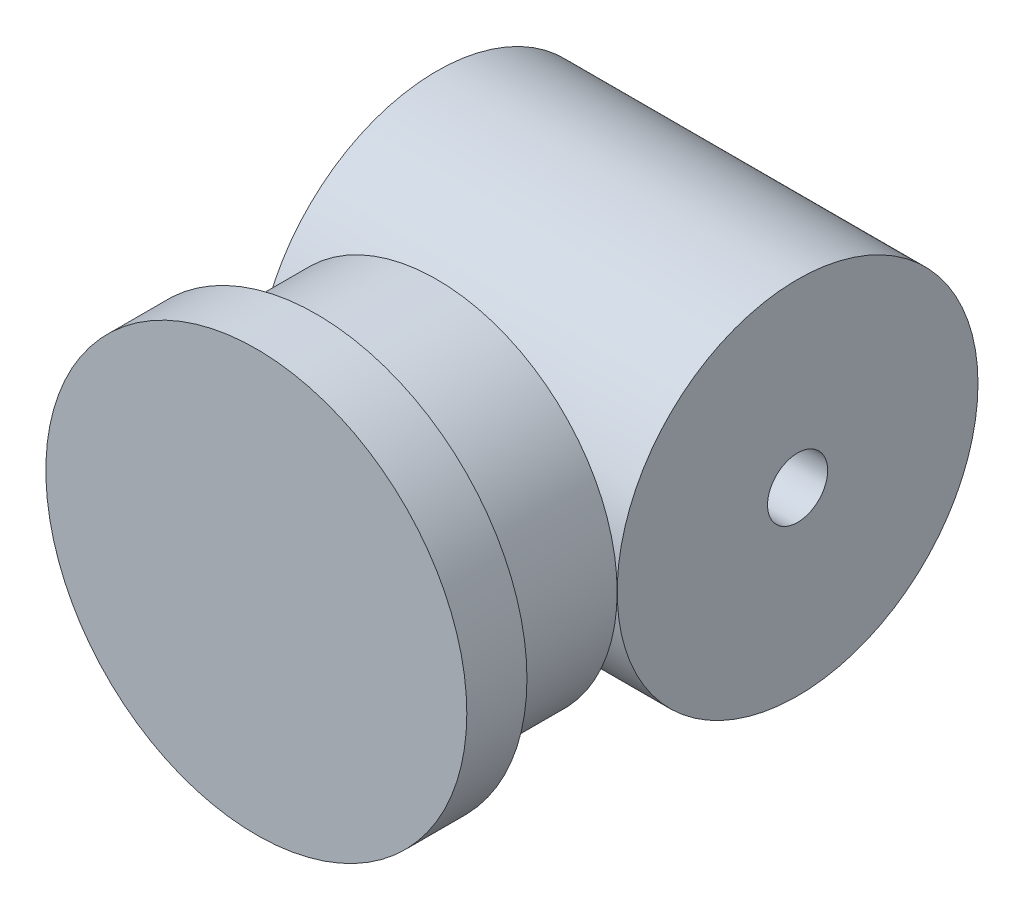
ISO-10303-21;
HEADER;
FILE_DESCRIPTION(('STEP AP214'),'2;1');
FILE_NAME('part.step','',(''),(''),'','','');
FILE_SCHEMA(('AUTOMOTIVE_DESIGN { 1 0 10303 214 1 1 1 1 }'));
ENDSEC;
DATA;
#1=APPLICATION_CONTEXT('core data for automotive mechanical design processes');
#2=APPLICATION_PROTOCOL_DEFINITION('international standard','automotive_design',2000,#1);
#3=PRODUCT_CONTEXT('',#1,'mechanical');
#4=PRODUCT('Part','Part','',(#3));
#5=PRODUCT_RELATED_PRODUCT_CATEGORY('part','',(#4));
#6=PRODUCT_DEFINITION_FORMATION('','',#4);
#7=PRODUCT_DEFINITION_CONTEXT('part definition',#1,'design');
#8=PRODUCT_DEFINITION('design','',#6,#7);
#9=PRODUCT_DEFINITION_SHAPE('','',#8);
#10=(LENGTH_UNIT() NAMED_UNIT(*) SI_UNIT(.MILLI.,.METRE.));
#11=(NAMED_UNIT(*) PLANE_ANGLE_UNIT() SI_UNIT($,.RADIAN.));
#12=(NAMED_UNIT(*) SI_UNIT($,.STERADIAN.) SOLID_ANGLE_UNIT());
#13=UNCERTAINTY_MEASURE_WITH_UNIT(LENGTH_MEASURE(1.E-05),#10,'distance_accuracy_value','');
#14=(GEOMETRIC_REPRESENTATION_CONTEXT(3) GLOBAL_UNCERTAINTY_ASSIGNED_CONTEXT((#13)) GLOBAL_UNIT_ASSIGNED_CONTEXT((#10,
#11,#12)) REPRESENTATION_CONTEXT('',''));
#15=CARTESIAN_POINT('',(0.,0.,0.));
#16=DIRECTION('',(0.,0.,1.));
#17=DIRECTION('',(1.,0.,0.));
#18=AXIS2_PLACEMENT_3D('',#15,#16,#17);
#19=CARTESIAN_POINT('',(30.,0.,-30.));
#20=DIRECTION('',(-1.,0.,0.));
#21=DIRECTION('',(0.,0.,1.));
#22=AXIS2_PLACEMENT_3D('',#19,#20,#21);
#23=CYLINDRICAL_SURFACE('',#22,30.);
#24=CARTESIAN_POINT('',(30.,0.,-30.));
#25=DIRECTION('',(1.,0.,0.));
#26=DIRECTION('',(0.,0.,-1.));
#27=AXIS2_PLACEMENT_3D('',#24,#25,#26);
#28=CIRCLE('',#27,30.);
#29=CARTESIAN_POINT('',(30.,0.,-60.));
#30=VERTEX_POINT('',#29);
#31=EDGE_CURVE('E11',#30,#30,#28,.T.);
#32=ORIENTED_EDGE('',*,*,#31,.F.);
#33=EDGE_LOOP('',(#32));
#34=FACE_BOUND('',#33,.T.);
#35=CARTESIAN_POINT('',(-30.,0.,-30.));
#36=DIRECTION('',(1.,0.,0.));
#37=DIRECTION('',(0.,0.,-1.));
#38=AXIS2_PLACEMENT_3D('',#35,#36,#37);
#39=CIRCLE('',#38,30.);
#40=CARTESIAN_POINT('',(-30.,0.,-60.));
#41=VERTEX_POINT('',#40);
#42=EDGE_CURVE('E46',#41,#41,#39,.T.);
#43=ORIENTED_EDGE('',*,*,#42,.T.);
#44=EDGE_LOOP('',(#43));
#45=FACE_BOUND('',#44,.T.);
#46=ADVANCED_FACE('F39',(#34,#45),#23,.T.);
#47=CARTESIAN_POINT('',(30.,0.,-30.));
#48=DIRECTION('',(1.,0.,0.));
#49=DIRECTION('',(0.,0.,-1.));
#50=AXIS2_PLACEMENT_3D('',#47,#48,#49);
#51=PLANE('',#50);
#52=CARTESIAN_POINT('',(30.,0.,-30.));
#53=DIRECTION('',(1.,0.,0.));
#54=DIRECTION('',(0.,0.,-1.));
#55=AXIS2_PLACEMENT_3D('',#52,#53,#54);
#56=CIRCLE('',#55,5.);
#57=CARTESIAN_POINT('',(30.,0.,-35.));
#58=VERTEX_POINT('',#57);
#59=EDGE_CURVE('E52',#58,#58,#56,.T.);
#60=ORIENTED_EDGE('',*,*,#59,.F.);
#61=EDGE_LOOP('',(#60));
#62=FACE_BOUND('',#61,.T.);
#63=ORIENTED_EDGE('',*,*,#31,.T.);
#64=EDGE_LOOP('',(#63));
#65=FACE_BOUND('',#64,.T.);
#66=ADVANCED_FACE('F68',(#62,#65),#51,.T.);
#67=CARTESIAN_POINT('',(-30.,0.,-30.));
#68=DIRECTION('',(1.,0.,0.));
#69=DIRECTION('',(0.,0.,-1.));
#70=AXIS2_PLACEMENT_3D('',#67,#68,#69);
#71=PLANE('',#70);
#72=CARTESIAN_POINT('',(-30.,0.,-30.));
#73=DIRECTION('',(1.,0.,0.));
#74=DIRECTION('',(0.,0.,-1.));
#75=AXIS2_PLACEMENT_3D('',#72,#73,#74);
#76=CIRCLE('',#75,5.);
#77=CARTESIAN_POINT('',(-30.,0.,-35.));
#78=VERTEX_POINT('',#77);
#79=EDGE_CURVE('E42',#78,#78,#76,.T.);
#80=ORIENTED_EDGE('',*,*,#79,.T.);
#81=EDGE_LOOP('',(#80));
#82=FACE_BOUND('',#81,.T.);
#83=ORIENTED_EDGE('',*,*,#42,.F.);
#84=EDGE_LOOP('',(#83));
#85=FACE_BOUND('',#84,.T.);
#86=ADVANCED_FACE('F59',(#82,#85),#71,.F.);
#87=CARTESIAN_POINT('',(-35.,0.,-30.));
#88=DIRECTION('',(1.,0.,0.));
#89=DIRECTION('',(0.,0.,-1.));
#90=AXIS2_PLACEMENT_3D('',#87,#88,#89);
#91=CYLINDRICAL_SURFACE('',#90,5.);
#92=ORIENTED_EDGE('',*,*,#59,.T.);
#93=EDGE_LOOP('',(#92));
#94=FACE_BOUND('',#93,.T.);
#95=ORIENTED_EDGE('',*,*,#79,.F.);
#96=EDGE_LOOP('',(#95));
#97=FACE_BOUND('',#96,.T.);
#98=ADVANCED_FACE('F62',(#94,#97),#91,.F.);
#99=CLOSED_SHELL('',(#46,#66,#86,#98));
#100=MANIFOLD_SOLID_BREP('B2',#99);
#101=CARTESIAN_POINT('',(0.,0.,20.));
#102=DIRECTION('',(0.,0.,-1.));
#103=DIRECTION('',(-1.,0.,0.));
#104=AXIS2_PLACEMENT_3D('',#101,#102,#103);
#105=CYLINDRICAL_SURFACE('',#104,30.);
#106=CARTESIAN_POINT('',(0.,0.,20.));
#107=DIRECTION('',(0.,0.,1.));
#108=DIRECTION('',(1.,0.,0.));
#109=AXIS2_PLACEMENT_3D('',#106,#107,#108);
#110=CIRCLE('',#109,30.);
#111=CARTESIAN_POINT('',(30.,0.,20.));
#112=VERTEX_POINT('',#111);
#113=EDGE_CURVE('E38',#112,#112,#110,.T.);
#114=ORIENTED_EDGE('',*,*,#113,.F.);
#115=EDGE_LOOP('',(#114));
#116=FACE_BOUND('',#115,.T.);
#117=CARTESIAN_POINT('',(0.,0.,0.));
#118=DIRECTION('',(0.,0.,1.));
#119=DIRECTION('',(1.,0.,0.));
#120=AXIS2_PLACEMENT_3D('',#117,#118,#119);
#121=CIRCLE('',#120,30.);
#122=CARTESIAN_POINT('',(30.,0.,0.));
#123=VERTEX_POINT('',#122);
#124=EDGE_CURVE('E104',#123,#123,#121,.T.);
#125=ORIENTED_EDGE('',*,*,#124,.T.);
#126=EDGE_LOOP('',(#125));
#127=FACE_BOUND('',#126,.T.);
#128=ADVANCED_FACE('F101',(#116,#127),#105,.T.);
#129=CARTESIAN_POINT('',(0.,0.,0.));
#130=DIRECTION('',(0.,0.,1.));
#131=DIRECTION('',(1.,0.,0.));
#132=AXIS2_PLACEMENT_3D('',#129,#130,#131);
#133=PLANE('',#132);
#134=ORIENTED_EDGE('',*,*,#124,.F.);
#135=EDGE_LOOP('',(#134));
#136=FACE_BOUND('',#135,.T.);
#137=ADVANCED_FACE('F129',(#136),#133,.F.);
#138=CARTESIAN_POINT('',(0.,0.,20.));
#139=DIRECTION('',(0.,0.,1.));
#140=DIRECTION('',(1.,0.,0.));
#141=AXIS2_PLACEMENT_3D('',#138,#139,#140);
#142=PLANE('',#141);
#143=CARTESIAN_POINT('',(0.,0.,20.));
#144=DIRECTION('',(0.,0.,1.));
#145=DIRECTION('',(1.,0.,0.));
#146=AXIS2_PLACEMENT_3D('',#143,#144,#145);
#147=CIRCLE('',#146,35.);
#148=CARTESIAN_POINT('',(35.,0.,20.));
#149=VERTEX_POINT('',#148);
#150=EDGE_CURVE('E113',#149,#149,#147,.T.);
#151=ORIENTED_EDGE('',*,*,#150,.F.);
#152=EDGE_LOOP('',(#151));
#153=FACE_BOUND('',#152,.T.);
#154=ORIENTED_EDGE('',*,*,#113,.T.);
#155=EDGE_LOOP('',(#154));
#156=FACE_BOUND('',#155,.T.);
#157=ADVANCED_FACE('F124',(#153,#156),#142,.F.);
#158=CARTESIAN_POINT('',(0.,0.,30.));
#159=DIRECTION('',(0.,0.,-1.));
#160=DIRECTION('',(-1.,0.,0.));
#161=AXIS2_PLACEMENT_3D('',#158,#159,#160);
#162=CYLINDRICAL_SURFACE('',#161,35.);
#163=CARTESIAN_POINT('',(0.,0.,30.));
#164=DIRECTION('',(0.,0.,1.));
#165=DIRECTION('',(1.,0.,0.));
#166=AXIS2_PLACEMENT_3D('',#163,#164,#165);
#167=CIRCLE('',#166,35.);
#168=CARTESIAN_POINT('',(35.,0.,30.));
#169=VERTEX_POINT('',#168);
#170=EDGE_CURVE('E111',#169,#169,#167,.T.);
#171=ORIENTED_EDGE('',*,*,#170,.F.);
#172=EDGE_LOOP('',(#171));
#173=FACE_BOUND('',#172,.T.);
#174=ORIENTED_EDGE('',*,*,#150,.T.);
#175=EDGE_LOOP('',(#174));
#176=FACE_BOUND('',#175,.T.);
#177=ADVANCED_FACE('F121',(#173,#176),#162,.T.);
#178=CARTESIAN_POINT('',(0.,0.,30.));
#179=DIRECTION('',(0.,0.,1.));
#180=DIRECTION('',(1.,0.,0.));
#181=AXIS2_PLACEMENT_3D('',#178,#179,#180);
#182=PLANE('',#181);
#183=ORIENTED_EDGE('',*,*,#170,.T.);
#184=EDGE_LOOP('',(#183));
#185=FACE_BOUND('',#184,.T.);
#186=ADVANCED_FACE('F119',(#185),#182,.T.);
#187=CLOSED_SHELL('',(#128,#137,#157,#177,#186));
#188=MANIFOLD_SOLID_BREP('B6',#187);
#189=ADVANCED_BREP_SHAPE_REPRESENTATION('',(#18,#100,#188),#14);
#190=SHAPE_DEFINITION_REPRESENTATION(#9,#189);
ENDSEC;
END-ISO-10303-21;
